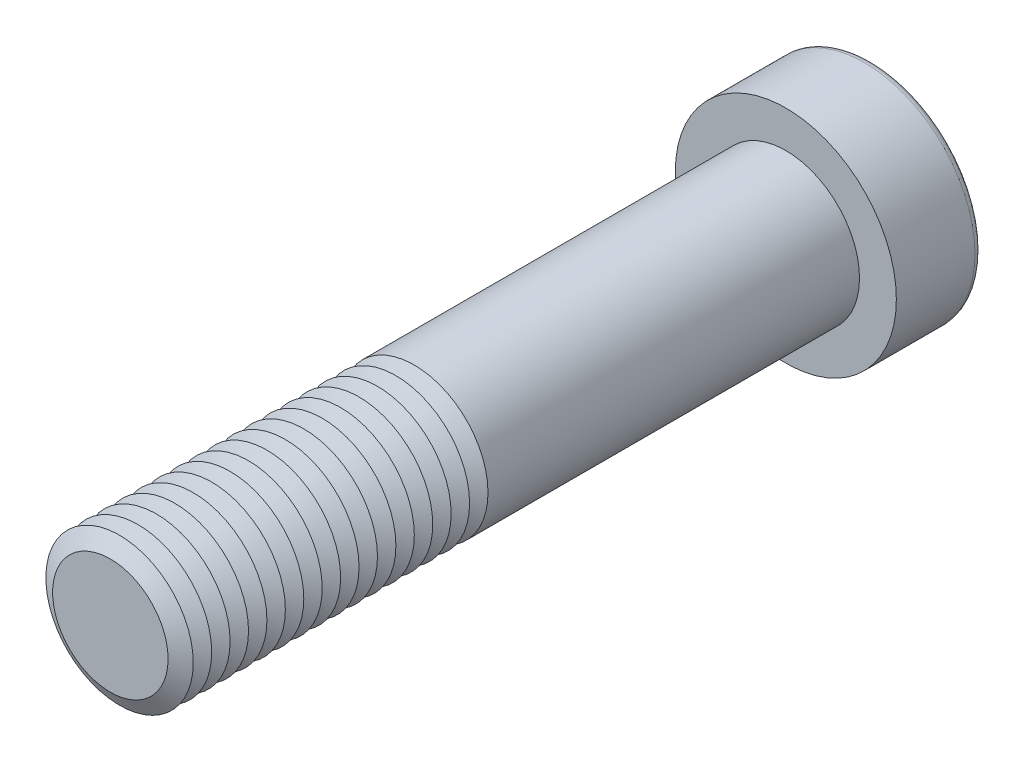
from build123d import *

# Parameters (mm, degrees)
SKETCH1_R           = 12
BOSS_EXTRUDE1_DEPTH = 110
SKETCH2_R           = 18
BOSS_EXTRUDE2_DEPTH = 14
CUT_EXTRUDE1_DEPTH  = 14.25
FILLET1_R           = 1.2
LPATTERN1_COUNT     = 17
LPATTERN1_PITCH     = 3


with BuildPart() as part:
    # Sketch1 → Boss-Extrude1 (new body)
    with BuildSketch(Plane.XY):
        Circle(SKETCH1_R)
    extrude(amount=BOSS_EXTRUDE1_DEPTH)

    # Sketch2 → Boss-Extrude2 (add)
    with BuildSketch(Plane(origin=(0, 0, 0), x_dir=(-1, 0, 0), z_dir=(0, 0, -1))):
        Circle(SKETCH2_R)
    extrude(amount=BOSS_EXTRUDE2_DEPTH)

    # Sketch3 → Cut-Extrude1 (cut)
    with BuildSketch(Plane(origin=(0, 0, -14), x_dir=(-1, 0, 0), z_dir=(0, 0, -1))):
        Polygon((-5.484827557, 9.5), (-10.969655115, 0), (-5.484827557, -9.5), (5.484827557, -9.5), (10.969655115, 0), (5.484827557, 9.5), align=None)
    extrude(amount=-CUT_EXTRUDE1_DEPTH, mode=Mode.SUBTRACT)

    # Fillet1
    fillet1_edges = [part.edges().sort_by_distance(p)[0] for p in [
        (18, 0, -14),
    ]]
    fillet(fillet1_edges, radius=FILLET1_R)

    # Cut-Extrude2 cone 1 section (on through the dimple's axis) → Cut-Extrude2 (revolve, cut)
    with BuildSketch(Plane(origin=(0, 0, 0.25), x_dir=(0, 1, 0), z_dir=(1, 0, 0))):
        Polygon((0, 0), (9.5, 0), (0, 5.484827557), align=None)
    revolve(axis=Axis((0, 0, 0.25), (0, 0, 1)), mode=Mode.SUBTRACT)

    # Cut-Extrude3 cone 1 section (on through the dimple's axis) → Cut-Extrude3 (revolve, cut)
    with BuildSketch(Plane(origin=(0, 0, -14), x_dir=(0, 1, 0), z_dir=(1, 0, 0))):
        Polygon((0, 0), (10.969655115, 0), (0, 2.939310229), align=None)
    revolve(axis=Axis((0, 0, -14), (0, 0, 1)), mode=Mode.SUBTRACT)

    # Sketch7 → Cut-Revolve1 (revolve, cut)
    with BuildSketch(Plane(origin=(0, 0, 0), x_dir=(0, 0, -1), z_dir=(1, 0, 0)), mode=Mode.PRIVATE) as cut_revolve1_sk:
        Polygon((-110, 9.401923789), (-108.5, 12), (-111.5, 12), align=None)
    cut_revolve1 = revolve(cut_revolve1_sk.sketch.rotate(Axis((0, 0, 110), (0, 0, -1)), 90), axis=Axis((0, 0, 110), (0, 0, -1)), mode=Mode.SUBTRACT)

    # LPattern1: Cut-Revolve1 ×17
    with Locations(*[(0, 0, -i * LPATTERN1_PITCH) for i in range(1, LPATTERN1_COUNT)]):
        add(cut_revolve1, mode=Mode.SUBTRACT)


solid = part.part
